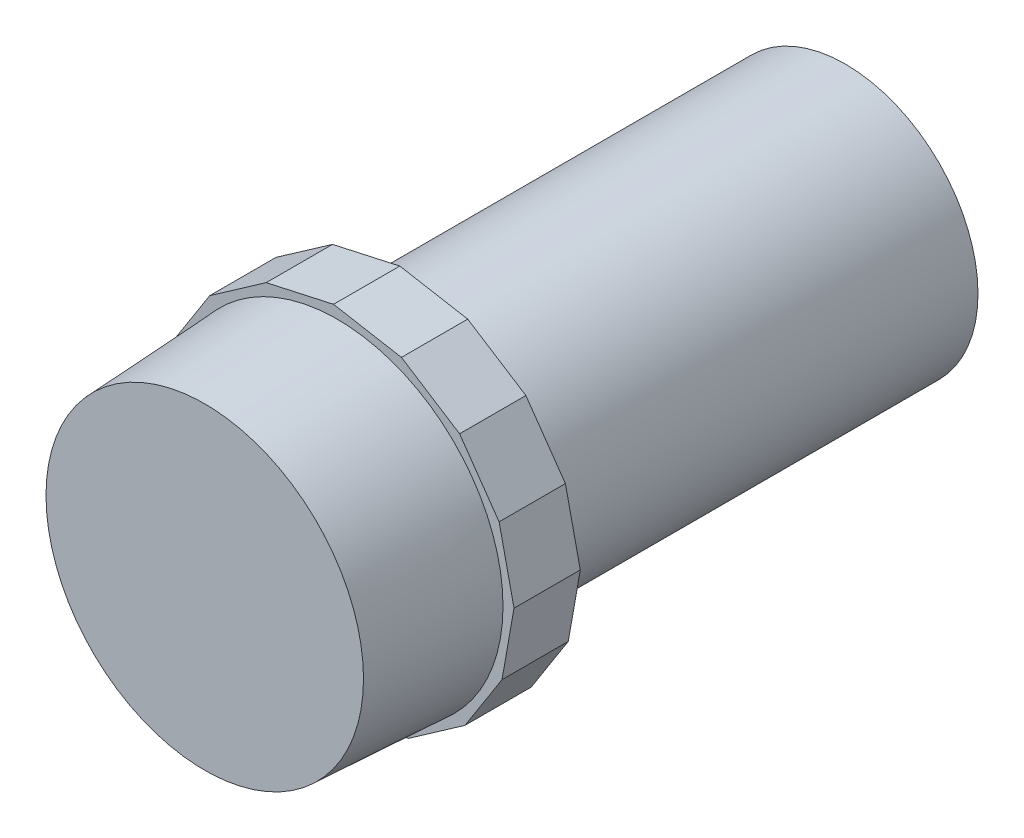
ISO-10303-21;
HEADER;
FILE_DESCRIPTION(('STEP AP214'),'2;1');
FILE_NAME('part.step','',(''),(''),'','','');
FILE_SCHEMA(('AUTOMOTIVE_DESIGN { 1 0 10303 214 1 1 1 1 }'));
ENDSEC;
DATA;
#1=APPLICATION_CONTEXT('core data for automotive mechanical design processes');
#2=APPLICATION_PROTOCOL_DEFINITION('international standard','automotive_design',2000,#1);
#3=PRODUCT_CONTEXT('',#1,'mechanical');
#4=PRODUCT('Part','Part','',(#3));
#5=PRODUCT_RELATED_PRODUCT_CATEGORY('part','',(#4));
#6=PRODUCT_DEFINITION_FORMATION('','',#4);
#7=PRODUCT_DEFINITION_CONTEXT('part definition',#1,'design');
#8=PRODUCT_DEFINITION('design','',#6,#7);
#9=PRODUCT_DEFINITION_SHAPE('','',#8);
#10=(LENGTH_UNIT() NAMED_UNIT(*) SI_UNIT(.MILLI.,.METRE.));
#11=(NAMED_UNIT(*) PLANE_ANGLE_UNIT() SI_UNIT($,.RADIAN.));
#12=(NAMED_UNIT(*) SI_UNIT($,.STERADIAN.) SOLID_ANGLE_UNIT());
#13=UNCERTAINTY_MEASURE_WITH_UNIT(LENGTH_MEASURE(1.E-05),#10,'distance_accuracy_value','');
#14=(GEOMETRIC_REPRESENTATION_CONTEXT(3) GLOBAL_UNCERTAINTY_ASSIGNED_CONTEXT((#13)) GLOBAL_UNIT_ASSIGNED_CONTEXT((#10,
#11,#12)) REPRESENTATION_CONTEXT('',''));
#15=CARTESIAN_POINT('',(0.,0.,0.));
#16=DIRECTION('',(0.,0.,1.));
#17=DIRECTION('',(1.,0.,0.));
#18=AXIS2_PLACEMENT_3D('',#15,#16,#17);
#19=CARTESIAN_POINT('',(0.,0.,-3.));
#20=DIRECTION('',(0.,0.,-1.));
#21=DIRECTION('',(-1.,0.,0.));
#22=AXIS2_PLACEMENT_3D('',#19,#20,#21);
#23=PLANE('',#22);
#24=CARTESIAN_POINT('',(0.,0.,-3.));
#25=DIRECTION('',(0.,0.,-1.));
#26=DIRECTION('',(-1.,0.,0.));
#27=AXIS2_PLACEMENT_3D('',#24,#25,#26);
#28=CIRCLE('',#27,6.);
#29=CARTESIAN_POINT('',(-6.,0.,-3.));
#30=VERTEX_POINT('',#29);
#31=EDGE_CURVE('E12',#30,#30,#28,.T.);
#32=ORIENTED_EDGE('',*,*,#31,.F.);
#33=EDGE_LOOP('',(#32));
#34=FACE_BOUND('',#33,.T.);
#35=DIRECTION('',(0.984722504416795,-0.17413095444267,0.));
#36=VECTOR('',#35,1.);
#37=CARTESIAN_POINT('',(1.36628061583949,7.72641070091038,-3.));
#38=LINE('',#37,#36);
#39=CARTESIAN_POINT('',(-0.170598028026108,7.99818081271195,-3.));
#40=VERTEX_POINT('',#39);
#41=CARTESIAN_POINT('',(2.90315925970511,7.4546405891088,-3.));
#42=VERTEX_POINT('',#41);
#43=EDGE_CURVE('E238',#40,#42,#38,.T.);
#44=ORIENTED_EDGE('',*,*,#43,.T.);
#45=DIRECTION('',(0.843127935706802,-0.537713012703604,0.));
#46=VECTOR('',#45,1.);
#47=CARTESIAN_POINT('',(4.21904806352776,6.61541975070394,-3.));
#48=LINE('',#47,#46);
#49=CARTESIAN_POINT('',(5.53493686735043,5.77619891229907,-3.));
#50=VERTEX_POINT('',#49);
#51=EDGE_CURVE('E224',#42,#50,#48,.T.);
#52=ORIENTED_EDGE('',*,*,#51,.T.);
#53=DIRECTION('',(0.573174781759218,-0.819433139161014,0.));
#54=VECTOR('',#53,1.);
#55=CARTESIAN_POINT('',(6.42950368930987,4.4972911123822,-3.));
#56=LINE('',#55,#54);
#57=CARTESIAN_POINT('',(7.32407051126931,3.21838331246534,-3.));
#58=VERTEX_POINT('',#57);
#59=EDGE_CURVE('E462',#50,#58,#56,.T.);
#60=ORIENTED_EDGE('',*,*,#59,.T.);
#61=DIRECTION('',(0.215960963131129,-0.976401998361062,0.));
#62=VECTOR('',#61,1.);
#63=CARTESIAN_POINT('',(7.66112566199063,1.69449067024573,-3.));
#64=LINE('',#63,#62);
#65=CARTESIAN_POINT('',(7.99818081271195,0.170598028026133,-3.));
#66=VERTEX_POINT('',#65);
#67=EDGE_CURVE('E121',#58,#66,#64,.T.);
#68=ORIENTED_EDGE('',*,*,#67,.T.);
#69=DIRECTION('',(-0.17413095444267,-0.984722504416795,0.));
#70=VECTOR('',#69,1.);
#71=CARTESIAN_POINT('',(7.72641070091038,-1.36628061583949,-3.));
#72=LINE('',#71,#70);
#73=CARTESIAN_POINT('',(7.45464058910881,-2.90315925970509,-3.));
#74=VERTEX_POINT('',#73);
#75=EDGE_CURVE('E310',#66,#74,#72,.T.);
#76=ORIENTED_EDGE('',*,*,#75,.T.);
#77=DIRECTION('',(-0.537713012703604,-0.843127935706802,0.));
#78=VECTOR('',#77,1.);
#79=CARTESIAN_POINT('',(6.61541975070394,-4.21904806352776,-3.));
#80=LINE('',#79,#78);
#81=CARTESIAN_POINT('',(5.77619891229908,-5.53493686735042,-3.));
#82=VERTEX_POINT('',#81);
#83=EDGE_CURVE('E113',#74,#82,#80,.T.);
#84=ORIENTED_EDGE('',*,*,#83,.T.);
#85=DIRECTION('',(-0.819433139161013,-0.573174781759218,0.));
#86=VECTOR('',#85,1.);
#87=CARTESIAN_POINT('',(4.4972911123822,-6.42950368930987,-3.));
#88=LINE('',#87,#86);
#89=CARTESIAN_POINT('',(3.21838331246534,-7.32407051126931,-3.));
#90=VERTEX_POINT('',#89);
#91=EDGE_CURVE('E297',#82,#90,#88,.T.);
#92=ORIENTED_EDGE('',*,*,#91,.T.);
#93=DIRECTION('',(-0.976401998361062,-0.215960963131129,0.));
#94=VECTOR('',#93,1.);
#95=CARTESIAN_POINT('',(1.69449067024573,-7.66112566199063,-3.));
#96=LINE('',#95,#94);
#97=CARTESIAN_POINT('',(0.170598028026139,-7.99818081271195,-3.));
#98=VERTEX_POINT('',#97);
#99=EDGE_CURVE('E423',#90,#98,#96,.T.);
#100=ORIENTED_EDGE('',*,*,#99,.T.);
#101=DIRECTION('',(-0.984722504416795,0.17413095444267,0.));
#102=VECTOR('',#101,1.);
#103=CARTESIAN_POINT('',(-1.36628061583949,-7.72641070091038,-3.));
#104=LINE('',#103,#102);
#105=CARTESIAN_POINT('',(-2.90315925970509,-7.45464058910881,-3.));
#106=VERTEX_POINT('',#105);
#107=EDGE_CURVE('E286',#98,#106,#104,.T.);
#108=ORIENTED_EDGE('',*,*,#107,.T.);
#109=DIRECTION('',(-0.843127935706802,0.537713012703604,0.));
#110=VECTOR('',#109,1.);
#111=CARTESIAN_POINT('',(-4.21904806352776,-6.61541975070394,-3.));
#112=LINE('',#111,#110);
#113=CARTESIAN_POINT('',(-5.53493686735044,-5.77619891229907,-3.));
#114=VERTEX_POINT('',#113);
#115=EDGE_CURVE('E426',#106,#114,#112,.T.);
#116=ORIENTED_EDGE('',*,*,#115,.T.);
#117=DIRECTION('',(-0.573174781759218,0.819433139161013,0.));
#118=VECTOR('',#117,1.);
#119=CARTESIAN_POINT('',(-6.42950368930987,-4.4972911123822,-3.));
#120=LINE('',#119,#118);
#121=CARTESIAN_POINT('',(-7.32407051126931,-3.21838331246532,-3.));
#122=VERTEX_POINT('',#121);
#123=EDGE_CURVE('E276',#114,#122,#120,.T.);
#124=ORIENTED_EDGE('',*,*,#123,.T.);
#125=DIRECTION('',(-0.215960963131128,0.976401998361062,0.));
#126=VECTOR('',#125,1.);
#127=CARTESIAN_POINT('',(-7.66112566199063,-1.69449067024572,-3.));
#128=LINE('',#127,#126);
#129=CARTESIAN_POINT('',(-7.99818081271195,-0.170598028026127,-3.));
#130=VERTEX_POINT('',#129);
#131=EDGE_CURVE('E437',#122,#130,#128,.T.);
#132=ORIENTED_EDGE('',*,*,#131,.T.);
#133=DIRECTION('',(0.17413095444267,0.984722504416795,0.));
#134=VECTOR('',#133,1.);
#135=CARTESIAN_POINT('',(-7.72641070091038,1.36628061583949,-3.));
#136=LINE('',#135,#134);
#137=CARTESIAN_POINT('',(-7.45464058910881,2.90315925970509,-3.));
#138=VERTEX_POINT('',#137);
#139=EDGE_CURVE('E266',#130,#138,#136,.T.);
#140=ORIENTED_EDGE('',*,*,#139,.T.);
#141=DIRECTION('',(0.537713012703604,0.843127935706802,0.));
#142=VECTOR('',#141,1.);
#143=CARTESIAN_POINT('',(-6.61541975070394,4.21904806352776,-3.));
#144=LINE('',#143,#142);
#145=CARTESIAN_POINT('',(-5.77619891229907,5.53493686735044,-3.));
#146=VERTEX_POINT('',#145);
#147=EDGE_CURVE('E446',#138,#146,#144,.T.);
#148=ORIENTED_EDGE('',*,*,#147,.T.);
#149=DIRECTION('',(0.819433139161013,0.573174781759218,0.));
#150=VECTOR('',#149,1.);
#151=CARTESIAN_POINT('',(-4.4972911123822,6.42950368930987,-3.));
#152=LINE('',#151,#150);
#153=CARTESIAN_POINT('',(-3.21838331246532,7.32407051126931,-3.));
#154=VERTEX_POINT('',#153);
#155=EDGE_CURVE('E259',#146,#154,#152,.T.);
#156=ORIENTED_EDGE('',*,*,#155,.T.);
#157=DIRECTION('',(0.976401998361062,0.215960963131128,0.));
#158=VECTOR('',#157,1.);
#159=CARTESIAN_POINT('',(-1.69449067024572,7.66112566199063,-3.));
#160=LINE('',#159,#158);
#161=EDGE_CURVE('E91',#154,#40,#160,.T.);
#162=ORIENTED_EDGE('',*,*,#161,.T.);
#163=EDGE_LOOP('',(#44,#52,#60,#68,#76,#84,#92,#100,#108,#116,#124,#132,#140,#148,#156,#162));
#164=FACE_BOUND('',#163,.T.);
#165=ADVANCED_FACE('F65',(#34,#164),#23,.T.);
#166=CARTESIAN_POINT('',(0.,0.,0.));
#167=DIRECTION('',(0.,0.,-1.));
#168=DIRECTION('',(-1.,0.,0.));
#169=AXIS2_PLACEMENT_3D('',#166,#167,#168);
#170=PLANE('',#169);
#171=CARTESIAN_POINT('',(0.,0.,0.));
#172=DIRECTION('',(0.,0.,1.));
#173=DIRECTION('',(1.,0.,0.));
#174=AXIS2_PLACEMENT_3D('',#171,#172,#173);
#175=CIRCLE('',#174,7.5);
#176=CARTESIAN_POINT('',(7.5,0.,0.));
#177=VERTEX_POINT('',#176);
#178=EDGE_CURVE('E242',#177,#177,#175,.T.);
#179=ORIENTED_EDGE('',*,*,#178,.F.);
#180=EDGE_LOOP('',(#179));
#181=FACE_BOUND('',#180,.T.);
#182=DIRECTION('',(0.843127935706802,-0.537713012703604,0.));
#183=VECTOR('',#182,1.);
#184=CARTESIAN_POINT('',(4.21904806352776,6.61541975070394,0.));
#185=LINE('',#184,#183);
#186=CARTESIAN_POINT('',(2.90315925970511,7.4546405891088,0.));
#187=VERTEX_POINT('',#186);
#188=CARTESIAN_POINT('',(5.53493686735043,5.77619891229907,0.));
#189=VERTEX_POINT('',#188);
#190=EDGE_CURVE('E82',#187,#189,#185,.T.);
#191=ORIENTED_EDGE('',*,*,#190,.F.);
#192=DIRECTION('',(0.984722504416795,-0.17413095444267,0.));
#193=VECTOR('',#192,1.);
#194=CARTESIAN_POINT('',(1.36628061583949,7.72641070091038,0.));
#195=LINE('',#194,#193);
#196=CARTESIAN_POINT('',(-0.170598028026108,7.99818081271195,0.));
#197=VERTEX_POINT('',#196);
#198=EDGE_CURVE('E240',#197,#187,#195,.T.);
#199=ORIENTED_EDGE('',*,*,#198,.F.);
#200=DIRECTION('',(0.976401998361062,0.215960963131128,0.));
#201=VECTOR('',#200,1.);
#202=CARTESIAN_POINT('',(-1.69449067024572,7.66112566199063,0.));
#203=LINE('',#202,#201);
#204=CARTESIAN_POINT('',(-3.21838331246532,7.32407051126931,0.));
#205=VERTEX_POINT('',#204);
#206=EDGE_CURVE('E127',#205,#197,#203,.T.);
#207=ORIENTED_EDGE('',*,*,#206,.F.);
#208=DIRECTION('',(0.819433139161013,0.573174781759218,0.));
#209=VECTOR('',#208,1.);
#210=CARTESIAN_POINT('',(-4.4972911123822,6.42950368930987,0.));
#211=LINE('',#210,#209);
#212=CARTESIAN_POINT('',(-5.77619891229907,5.53493686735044,0.));
#213=VERTEX_POINT('',#212);
#214=EDGE_CURVE('E250',#213,#205,#211,.T.);
#215=ORIENTED_EDGE('',*,*,#214,.F.);
#216=DIRECTION('',(0.537713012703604,0.843127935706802,0.));
#217=VECTOR('',#216,1.);
#218=CARTESIAN_POINT('',(-6.61541975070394,4.21904806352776,0.));
#219=LINE('',#218,#217);
#220=CARTESIAN_POINT('',(-7.45464058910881,2.90315925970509,0.));
#221=VERTEX_POINT('',#220);
#222=EDGE_CURVE('E141',#221,#213,#219,.T.);
#223=ORIENTED_EDGE('',*,*,#222,.F.);
#224=DIRECTION('',(0.17413095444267,0.984722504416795,0.));
#225=VECTOR('',#224,1.);
#226=CARTESIAN_POINT('',(-7.72641070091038,1.36628061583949,0.));
#227=LINE('',#226,#225);
#228=CARTESIAN_POINT('',(-7.99818081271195,-0.170598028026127,0.));
#229=VERTEX_POINT('',#228);
#230=EDGE_CURVE('E262',#229,#221,#227,.T.);
#231=ORIENTED_EDGE('',*,*,#230,.F.);
#232=DIRECTION('',(-0.215960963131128,0.976401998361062,0.));
#233=VECTOR('',#232,1.);
#234=CARTESIAN_POINT('',(-7.66112566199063,-1.69449067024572,0.));
#235=LINE('',#234,#233);
#236=CARTESIAN_POINT('',(-7.32407051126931,-3.21838331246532,0.));
#237=VERTEX_POINT('',#236);
#238=EDGE_CURVE('E156',#237,#229,#235,.T.);
#239=ORIENTED_EDGE('',*,*,#238,.F.);
#240=DIRECTION('',(-0.573174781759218,0.819433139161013,0.));
#241=VECTOR('',#240,1.);
#242=CARTESIAN_POINT('',(-6.42950368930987,-4.4972911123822,0.));
#243=LINE('',#242,#241);
#244=CARTESIAN_POINT('',(-5.53493686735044,-5.77619891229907,0.));
#245=VERTEX_POINT('',#244);
#246=EDGE_CURVE('E272',#245,#237,#243,.T.);
#247=ORIENTED_EDGE('',*,*,#246,.F.);
#248=DIRECTION('',(-0.843127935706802,0.537713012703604,0.));
#249=VECTOR('',#248,1.);
#250=CARTESIAN_POINT('',(-4.21904806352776,-6.61541975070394,0.));
#251=LINE('',#250,#249);
#252=CARTESIAN_POINT('',(-2.90315925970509,-7.45464058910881,0.));
#253=VERTEX_POINT('',#252);
#254=EDGE_CURVE('E171',#253,#245,#251,.T.);
#255=ORIENTED_EDGE('',*,*,#254,.F.);
#256=DIRECTION('',(-0.984722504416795,0.17413095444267,0.));
#257=VECTOR('',#256,1.);
#258=CARTESIAN_POINT('',(-1.36628061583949,-7.72641070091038,0.));
#259=LINE('',#258,#257);
#260=CARTESIAN_POINT('',(0.170598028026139,-7.99818081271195,0.));
#261=VERTEX_POINT('',#260);
#262=EDGE_CURVE('E282',#261,#253,#259,.T.);
#263=ORIENTED_EDGE('',*,*,#262,.F.);
#264=DIRECTION('',(-0.976401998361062,-0.215960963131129,0.));
#265=VECTOR('',#264,1.);
#266=CARTESIAN_POINT('',(1.69449067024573,-7.66112566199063,0.));
#267=LINE('',#266,#265);
#268=CARTESIAN_POINT('',(3.21838331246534,-7.32407051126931,0.));
#269=VERTEX_POINT('',#268);
#270=EDGE_CURVE('E186',#269,#261,#267,.T.);
#271=ORIENTED_EDGE('',*,*,#270,.F.);
#272=DIRECTION('',(-0.819433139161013,-0.573174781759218,0.));
#273=VECTOR('',#272,1.);
#274=CARTESIAN_POINT('',(4.4972911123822,-6.42950368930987,0.));
#275=LINE('',#274,#273);
#276=CARTESIAN_POINT('',(5.77619891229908,-5.53493686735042,0.));
#277=VERTEX_POINT('',#276);
#278=EDGE_CURVE('E293',#277,#269,#275,.T.);
#279=ORIENTED_EDGE('',*,*,#278,.F.);
#280=DIRECTION('',(-0.537713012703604,-0.843127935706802,0.));
#281=VECTOR('',#280,1.);
#282=CARTESIAN_POINT('',(6.61541975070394,-4.21904806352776,0.));
#283=LINE('',#282,#281);
#284=CARTESIAN_POINT('',(7.45464058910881,-2.90315925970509,0.));
#285=VERTEX_POINT('',#284);
#286=EDGE_CURVE('E198',#285,#277,#283,.T.);
#287=ORIENTED_EDGE('',*,*,#286,.F.);
#288=DIRECTION('',(-0.17413095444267,-0.984722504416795,0.));
#289=VECTOR('',#288,1.);
#290=CARTESIAN_POINT('',(7.72641070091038,-1.36628061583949,0.));
#291=LINE('',#290,#289);
#292=CARTESIAN_POINT('',(7.99818081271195,0.170598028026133,0.));
#293=VERTEX_POINT('',#292);
#294=EDGE_CURVE('E306',#293,#285,#291,.T.);
#295=ORIENTED_EDGE('',*,*,#294,.F.);
#296=DIRECTION('',(0.215960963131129,-0.976401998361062,0.));
#297=VECTOR('',#296,1.);
#298=CARTESIAN_POINT('',(7.66112566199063,1.69449067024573,0.));
#299=LINE('',#298,#297);
#300=CARTESIAN_POINT('',(7.32407051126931,3.21838331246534,0.));
#301=VERTEX_POINT('',#300);
#302=EDGE_CURVE('E209',#301,#293,#299,.T.);
#303=ORIENTED_EDGE('',*,*,#302,.F.);
#304=DIRECTION('',(0.573174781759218,-0.819433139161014,0.));
#305=VECTOR('',#304,1.);
#306=CARTESIAN_POINT('',(6.42950368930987,4.4972911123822,0.));
#307=LINE('',#306,#305);
#308=EDGE_CURVE('E463',#189,#301,#307,.T.);
#309=ORIENTED_EDGE('',*,*,#308,.F.);
#310=EDGE_LOOP('',(#191,#199,#207,#215,#223,#231,#239,#247,#255,#263,#271,#279,#287,#295,#303,#309));
#311=FACE_BOUND('',#310,.T.);
#312=ADVANCED_FACE('F326',(#181,#311),#170,.F.);
#313=CARTESIAN_POINT('',(0.,0.,0.));
#314=DIRECTION('',(0.,0.,-1.));
#315=DIRECTION('',(1.,0.,0.));
#316=AXIS2_PLACEMENT_3D('',#313,#314,#315);
#317=CONICAL_SURFACE('',#316,7.5,0.0523598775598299);
#318=CARTESIAN_POINT('',(0.,0.,6.));
#319=DIRECTION('',(0.,0.,1.));
#320=DIRECTION('',(1.,0.,0.));
#321=AXIS2_PLACEMENT_3D('',#318,#319,#320);
#322=CIRCLE('',#321,7.18555332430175);
#323=CARTESIAN_POINT('',(7.18555332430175,0.,6.));
#324=VERTEX_POINT('',#323);
#325=EDGE_CURVE('E69',#324,#324,#322,.T.);
#326=ORIENTED_EDGE('',*,*,#325,.F.);
#327=EDGE_LOOP('',(#326));
#328=FACE_BOUND('',#327,.T.);
#329=ORIENTED_EDGE('',*,*,#178,.T.);
#330=EDGE_LOOP('',(#329));
#331=FACE_BOUND('',#330,.T.);
#332=ADVANCED_FACE('F67',(#328,#331),#317,.T.);
#333=CARTESIAN_POINT('',(0.,0.,6.));
#334=DIRECTION('',(0.,0.,1.));
#335=DIRECTION('',(1.,0.,0.));
#336=AXIS2_PLACEMENT_3D('',#333,#334,#335);
#337=PLANE('',#336);
#338=ORIENTED_EDGE('',*,*,#325,.T.);
#339=EDGE_LOOP('',(#338));
#340=FACE_BOUND('',#339,.T.);
#341=ADVANCED_FACE('F323',(#340),#337,.T.);
#342=CARTESIAN_POINT('',(1.36628061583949,7.72641070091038,0.));
#343=DIRECTION('',(0.17413095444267,0.984722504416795,0.));
#344=DIRECTION('',(-0.984722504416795,0.17413095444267,0.));
#345=AXIS2_PLACEMENT_3D('',#342,#343,#344);
#346=PLANE('',#345);
#347=ORIENTED_EDGE('',*,*,#43,.F.);
#348=DIRECTION('',(0.,0.,-1.));
#349=VECTOR('',#348,1.);
#350=CARTESIAN_POINT('',(-0.170598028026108,7.99818081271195,0.));
#351=LINE('',#350,#349);
#352=EDGE_CURVE('E133',#197,#40,#351,.T.);
#353=ORIENTED_EDGE('',*,*,#352,.F.);
#354=ORIENTED_EDGE('',*,*,#198,.T.);
#355=DIRECTION('',(0.,0.,-1.));
#356=VECTOR('',#355,1.);
#357=CARTESIAN_POINT('',(2.90315925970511,7.4546405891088,0.));
#358=LINE('',#357,#356);
#359=EDGE_CURVE('E220',#187,#42,#358,.T.);
#360=ORIENTED_EDGE('',*,*,#359,.T.);
#361=EDGE_LOOP('',(#347,#353,#354,#360));
#362=FACE_BOUND('',#361,.T.);
#363=ADVANCED_FACE('F237',(#362),#346,.T.);
#364=CARTESIAN_POINT('',(-4.4972911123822,6.42950368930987,0.));
#365=DIRECTION('',(-0.573174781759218,0.819433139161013,0.));
#366=DIRECTION('',(-0.819433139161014,-0.573174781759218,0.));
#367=AXIS2_PLACEMENT_3D('',#364,#365,#366);
#368=PLANE('',#367);
#369=ORIENTED_EDGE('',*,*,#155,.F.);
#370=DIRECTION('',(0.,0.,-1.));
#371=VECTOR('',#370,1.);
#372=CARTESIAN_POINT('',(-5.77619891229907,5.53493686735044,0.));
#373=LINE('',#372,#371);
#374=EDGE_CURVE('E147',#213,#146,#373,.T.);
#375=ORIENTED_EDGE('',*,*,#374,.F.);
#376=ORIENTED_EDGE('',*,*,#214,.T.);
#377=DIRECTION('',(0.,0.,-1.));
#378=VECTOR('',#377,1.);
#379=CARTESIAN_POINT('',(-3.21838331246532,7.32407051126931,0.));
#380=LINE('',#379,#378);
#381=EDGE_CURVE('E457',#205,#154,#380,.T.);
#382=ORIENTED_EDGE('',*,*,#381,.T.);
#383=EDGE_LOOP('',(#369,#375,#376,#382));
#384=FACE_BOUND('',#383,.T.);
#385=ADVANCED_FACE('F360',(#384),#368,.T.);
#386=CARTESIAN_POINT('',(-7.72641070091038,1.36628061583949,0.));
#387=DIRECTION('',(-0.984722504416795,0.17413095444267,0.));
#388=DIRECTION('',(-0.17413095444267,-0.984722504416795,0.));
#389=AXIS2_PLACEMENT_3D('',#386,#387,#388);
#390=PLANE('',#389);
#391=ORIENTED_EDGE('',*,*,#139,.F.);
#392=DIRECTION('',(0.,0.,-1.));
#393=VECTOR('',#392,1.);
#394=CARTESIAN_POINT('',(-7.99818081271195,-0.170598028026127,0.));
#395=LINE('',#394,#393);
#396=EDGE_CURVE('E162',#229,#130,#395,.T.);
#397=ORIENTED_EDGE('',*,*,#396,.F.);
#398=ORIENTED_EDGE('',*,*,#230,.T.);
#399=DIRECTION('',(0.,0.,-1.));
#400=VECTOR('',#399,1.);
#401=CARTESIAN_POINT('',(-7.45464058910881,2.90315925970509,0.));
#402=LINE('',#401,#400);
#403=EDGE_CURVE('E449',#221,#138,#402,.T.);
#404=ORIENTED_EDGE('',*,*,#403,.T.);
#405=EDGE_LOOP('',(#391,#397,#398,#404));
#406=FACE_BOUND('',#405,.T.);
#407=ADVANCED_FACE('F356',(#406),#390,.T.);
#408=CARTESIAN_POINT('',(-6.42950368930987,-4.4972911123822,0.));
#409=DIRECTION('',(-0.819433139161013,-0.573174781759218,0.));
#410=DIRECTION('',(0.573174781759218,-0.819433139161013,0.));
#411=AXIS2_PLACEMENT_3D('',#408,#409,#410);
#412=PLANE('',#411);
#413=ORIENTED_EDGE('',*,*,#123,.F.);
#414=DIRECTION('',(0.,0.,-1.));
#415=VECTOR('',#414,1.);
#416=CARTESIAN_POINT('',(-5.53493686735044,-5.77619891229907,0.));
#417=LINE('',#416,#415);
#418=EDGE_CURVE('E177',#245,#114,#417,.T.);
#419=ORIENTED_EDGE('',*,*,#418,.F.);
#420=ORIENTED_EDGE('',*,*,#246,.T.);
#421=DIRECTION('',(0.,0.,-1.));
#422=VECTOR('',#421,1.);
#423=CARTESIAN_POINT('',(-7.32407051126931,-3.21838331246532,0.));
#424=LINE('',#423,#422);
#425=EDGE_CURVE('E440',#237,#122,#424,.T.);
#426=ORIENTED_EDGE('',*,*,#425,.T.);
#427=EDGE_LOOP('',(#413,#419,#420,#426));
#428=FACE_BOUND('',#427,.T.);
#429=ADVANCED_FACE('F352',(#428),#412,.T.);
#430=CARTESIAN_POINT('',(-1.36628061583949,-7.72641070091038,0.));
#431=DIRECTION('',(-0.174130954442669,-0.984722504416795,0.));
#432=DIRECTION('',(0.984722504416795,-0.17413095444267,0.));
#433=AXIS2_PLACEMENT_3D('',#430,#431,#432);
#434=PLANE('',#433);
#435=ORIENTED_EDGE('',*,*,#107,.F.);
#436=DIRECTION('',(0.,0.,-1.));
#437=VECTOR('',#436,1.);
#438=CARTESIAN_POINT('',(0.170598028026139,-7.99818081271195,0.));
#439=LINE('',#438,#437);
#440=EDGE_CURVE('E192',#261,#98,#439,.T.);
#441=ORIENTED_EDGE('',*,*,#440,.F.);
#442=ORIENTED_EDGE('',*,*,#262,.T.);
#443=DIRECTION('',(0.,0.,-1.));
#444=VECTOR('',#443,1.);
#445=CARTESIAN_POINT('',(-2.90315925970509,-7.45464058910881,0.));
#446=LINE('',#445,#444);
#447=EDGE_CURVE('E431',#253,#106,#446,.T.);
#448=ORIENTED_EDGE('',*,*,#447,.T.);
#449=EDGE_LOOP('',(#435,#441,#442,#448));
#450=FACE_BOUND('',#449,.T.);
#451=ADVANCED_FACE('F348',(#450),#434,.T.);
#452=CARTESIAN_POINT('',(4.4972911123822,-6.42950368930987,0.));
#453=DIRECTION('',(0.573174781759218,-0.819433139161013,0.));
#454=DIRECTION('',(0.819433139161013,0.573174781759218,0.));
#455=AXIS2_PLACEMENT_3D('',#452,#453,#454);
#456=PLANE('',#455);
#457=ORIENTED_EDGE('',*,*,#91,.F.);
#458=DIRECTION('',(0.,0.,-1.));
#459=VECTOR('',#458,1.);
#460=CARTESIAN_POINT('',(5.77619891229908,-5.53493686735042,0.));
#461=LINE('',#460,#459);
#462=EDGE_CURVE('E204',#277,#82,#461,.T.);
#463=ORIENTED_EDGE('',*,*,#462,.F.);
#464=ORIENTED_EDGE('',*,*,#278,.T.);
#465=DIRECTION('',(0.,0.,-1.));
#466=VECTOR('',#465,1.);
#467=CARTESIAN_POINT('',(3.21838331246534,-7.32407051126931,0.));
#468=LINE('',#467,#466);
#469=EDGE_CURVE('E290',#269,#90,#468,.T.);
#470=ORIENTED_EDGE('',*,*,#469,.T.);
#471=EDGE_LOOP('',(#457,#463,#464,#470));
#472=FACE_BOUND('',#471,.T.);
#473=ADVANCED_FACE('F344',(#472),#456,.T.);
#474=CARTESIAN_POINT('',(7.72641070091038,-1.36628061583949,0.));
#475=DIRECTION('',(0.984722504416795,-0.17413095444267,0.));
#476=DIRECTION('',(0.17413095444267,0.984722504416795,0.));
#477=AXIS2_PLACEMENT_3D('',#474,#475,#476);
#478=PLANE('',#477);
#479=ORIENTED_EDGE('',*,*,#75,.F.);
#480=DIRECTION('',(0.,0.,-1.));
#481=VECTOR('',#480,1.);
#482=CARTESIAN_POINT('',(7.99818081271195,0.170598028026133,0.));
#483=LINE('',#482,#481);
#484=EDGE_CURVE('E215',#293,#66,#483,.T.);
#485=ORIENTED_EDGE('',*,*,#484,.F.);
#486=ORIENTED_EDGE('',*,*,#294,.T.);
#487=DIRECTION('',(0.,0.,-1.));
#488=VECTOR('',#487,1.);
#489=CARTESIAN_POINT('',(7.45464058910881,-2.90315925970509,0.));
#490=LINE('',#489,#488);
#491=EDGE_CURVE('E418',#285,#74,#490,.T.);
#492=ORIENTED_EDGE('',*,*,#491,.T.);
#493=EDGE_LOOP('',(#479,#485,#486,#492));
#494=FACE_BOUND('',#493,.T.);
#495=ADVANCED_FACE('F340',(#494),#478,.T.);
#496=CARTESIAN_POINT('',(6.42950368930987,4.4972911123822,0.));
#497=DIRECTION('',(0.819433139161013,0.573174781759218,0.));
#498=DIRECTION('',(-0.573174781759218,0.819433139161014,0.));
#499=AXIS2_PLACEMENT_3D('',#496,#497,#498);
#500=PLANE('',#499);
#501=ORIENTED_EDGE('',*,*,#59,.F.);
#502=DIRECTION('',(0.,0.,-1.));
#503=VECTOR('',#502,1.);
#504=CARTESIAN_POINT('',(5.53493686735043,5.77619891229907,0.));
#505=LINE('',#504,#503);
#506=EDGE_CURVE('E226',#189,#50,#505,.T.);
#507=ORIENTED_EDGE('',*,*,#506,.F.);
#508=ORIENTED_EDGE('',*,*,#308,.T.);
#509=DIRECTION('',(0.,0.,-1.));
#510=VECTOR('',#509,1.);
#511=CARTESIAN_POINT('',(7.32407051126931,3.21838331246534,0.));
#512=LINE('',#511,#510);
#513=EDGE_CURVE('E411',#301,#58,#512,.T.);
#514=ORIENTED_EDGE('',*,*,#513,.T.);
#515=EDGE_LOOP('',(#501,#507,#508,#514));
#516=FACE_BOUND('',#515,.T.);
#517=ADVANCED_FACE('F343',(#516),#500,.T.);
#518=CARTESIAN_POINT('',(-1.69449067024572,7.66112566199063,0.));
#519=DIRECTION('',(-0.215960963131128,0.976401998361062,0.));
#520=DIRECTION('',(-0.976401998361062,-0.215960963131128,0.));
#521=AXIS2_PLACEMENT_3D('',#518,#519,#520);
#522=PLANE('',#521);
#523=ORIENTED_EDGE('',*,*,#161,.F.);
#524=ORIENTED_EDGE('',*,*,#381,.F.);
#525=ORIENTED_EDGE('',*,*,#206,.T.);
#526=ORIENTED_EDGE('',*,*,#352,.T.);
#527=EDGE_LOOP('',(#523,#524,#525,#526));
#528=FACE_BOUND('',#527,.T.);
#529=ADVANCED_FACE('F369',(#528),#522,.T.);
#530=CARTESIAN_POINT('',(-6.61541975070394,4.21904806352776,0.));
#531=DIRECTION('',(-0.843127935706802,0.537713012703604,0.));
#532=DIRECTION('',(-0.537713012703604,-0.843127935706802,0.));
#533=AXIS2_PLACEMENT_3D('',#530,#531,#532);
#534=PLANE('',#533);
#535=ORIENTED_EDGE('',*,*,#147,.F.);
#536=ORIENTED_EDGE('',*,*,#403,.F.);
#537=ORIENTED_EDGE('',*,*,#222,.T.);
#538=ORIENTED_EDGE('',*,*,#374,.T.);
#539=EDGE_LOOP('',(#535,#536,#537,#538));
#540=FACE_BOUND('',#539,.T.);
#541=ADVANCED_FACE('F373',(#540),#534,.T.);
#542=CARTESIAN_POINT('',(-7.66112566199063,-1.69449067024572,0.));
#543=DIRECTION('',(-0.976401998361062,-0.215960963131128,0.));
#544=DIRECTION('',(0.215960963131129,-0.976401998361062,0.));
#545=AXIS2_PLACEMENT_3D('',#542,#543,#544);
#546=PLANE('',#545);
#547=ORIENTED_EDGE('',*,*,#131,.F.);
#548=ORIENTED_EDGE('',*,*,#425,.F.);
#549=ORIENTED_EDGE('',*,*,#238,.T.);
#550=ORIENTED_EDGE('',*,*,#396,.T.);
#551=EDGE_LOOP('',(#547,#548,#549,#550));
#552=FACE_BOUND('',#551,.T.);
#553=ADVANCED_FACE('F376',(#552),#546,.T.);
#554=CARTESIAN_POINT('',(-4.21904806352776,-6.61541975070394,0.));
#555=DIRECTION('',(-0.537713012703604,-0.843127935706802,0.));
#556=DIRECTION('',(0.843127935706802,-0.537713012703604,0.));
#557=AXIS2_PLACEMENT_3D('',#554,#555,#556);
#558=PLANE('',#557);
#559=ORIENTED_EDGE('',*,*,#115,.F.);
#560=ORIENTED_EDGE('',*,*,#447,.F.);
#561=ORIENTED_EDGE('',*,*,#254,.T.);
#562=ORIENTED_EDGE('',*,*,#418,.T.);
#563=EDGE_LOOP('',(#559,#560,#561,#562));
#564=FACE_BOUND('',#563,.T.);
#565=ADVANCED_FACE('F379',(#564),#558,.T.);
#566=CARTESIAN_POINT('',(1.69449067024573,-7.66112566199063,0.));
#567=DIRECTION('',(0.215960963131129,-0.976401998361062,0.));
#568=DIRECTION('',(0.976401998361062,0.215960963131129,0.));
#569=AXIS2_PLACEMENT_3D('',#566,#567,#568);
#570=PLANE('',#569);
#571=ORIENTED_EDGE('',*,*,#99,.F.);
#572=ORIENTED_EDGE('',*,*,#469,.F.);
#573=ORIENTED_EDGE('',*,*,#270,.T.);
#574=ORIENTED_EDGE('',*,*,#440,.T.);
#575=EDGE_LOOP('',(#571,#572,#573,#574));
#576=FACE_BOUND('',#575,.T.);
#577=ADVANCED_FACE('F382',(#576),#570,.T.);
#578=CARTESIAN_POINT('',(6.61541975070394,-4.21904806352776,0.));
#579=DIRECTION('',(0.843127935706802,-0.537713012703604,0.));
#580=DIRECTION('',(0.537713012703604,0.843127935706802,0.));
#581=AXIS2_PLACEMENT_3D('',#578,#579,#580);
#582=PLANE('',#581);
#583=ORIENTED_EDGE('',*,*,#83,.F.);
#584=ORIENTED_EDGE('',*,*,#491,.F.);
#585=ORIENTED_EDGE('',*,*,#286,.T.);
#586=ORIENTED_EDGE('',*,*,#462,.T.);
#587=EDGE_LOOP('',(#583,#584,#585,#586));
#588=FACE_BOUND('',#587,.T.);
#589=ADVANCED_FACE('F385',(#588),#582,.T.);
#590=CARTESIAN_POINT('',(7.66112566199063,1.69449067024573,0.));
#591=DIRECTION('',(0.976401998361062,0.215960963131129,0.));
#592=DIRECTION('',(-0.215960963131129,0.976401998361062,0.));
#593=AXIS2_PLACEMENT_3D('',#590,#591,#592);
#594=PLANE('',#593);
#595=ORIENTED_EDGE('',*,*,#67,.F.);
#596=ORIENTED_EDGE('',*,*,#513,.F.);
#597=ORIENTED_EDGE('',*,*,#302,.T.);
#598=ORIENTED_EDGE('',*,*,#484,.T.);
#599=EDGE_LOOP('',(#595,#596,#597,#598));
#600=FACE_BOUND('',#599,.T.);
#601=ADVANCED_FACE('F388',(#600),#594,.T.);
#602=CARTESIAN_POINT('',(4.21904806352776,6.61541975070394,0.));
#603=DIRECTION('',(0.537713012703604,0.843127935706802,0.));
#604=DIRECTION('',(-0.843127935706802,0.537713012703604,0.));
#605=AXIS2_PLACEMENT_3D('',#602,#603,#604);
#606=PLANE('',#605);
#607=ORIENTED_EDGE('',*,*,#51,.F.);
#608=ORIENTED_EDGE('',*,*,#359,.F.);
#609=ORIENTED_EDGE('',*,*,#190,.T.);
#610=ORIENTED_EDGE('',*,*,#506,.T.);
#611=EDGE_LOOP('',(#607,#608,#609,#610));
#612=FACE_BOUND('',#611,.T.);
#613=ADVANCED_FACE('F225',(#612),#606,.T.);
#614=CARTESIAN_POINT('',(0.,0.,-23.));
#615=DIRECTION('',(0.,0.,1.));
#616=DIRECTION('',(1.,0.,0.));
#617=AXIS2_PLACEMENT_3D('',#614,#615,#616);
#618=CYLINDRICAL_SURFACE('',#617,6.);
#619=CARTESIAN_POINT('',(0.,0.,-23.));
#620=DIRECTION('',(0.,0.,-1.));
#621=DIRECTION('',(-1.,0.,0.));
#622=AXIS2_PLACEMENT_3D('',#619,#620,#621);
#623=CIRCLE('',#622,6.);
#624=CARTESIAN_POINT('',(-6.,0.,-23.));
#625=VERTEX_POINT('',#624);
#626=EDGE_CURVE('E232',#625,#625,#623,.T.);
#627=ORIENTED_EDGE('',*,*,#626,.F.);
#628=EDGE_LOOP('',(#627));
#629=FACE_BOUND('',#628,.T.);
#630=ORIENTED_EDGE('',*,*,#31,.T.);
#631=EDGE_LOOP('',(#630));
#632=FACE_BOUND('',#631,.T.);
#633=ADVANCED_FACE('F393',(#629,#632),#618,.T.);
#634=CARTESIAN_POINT('',(0.,0.,-23.));
#635=DIRECTION('',(0.,0.,-1.));
#636=DIRECTION('',(-1.,0.,0.));
#637=AXIS2_PLACEMENT_3D('',#634,#635,#636);
#638=PLANE('',#637);
#639=ORIENTED_EDGE('',*,*,#626,.T.);
#640=EDGE_LOOP('',(#639));
#641=FACE_BOUND('',#640,.T.);
#642=ADVANCED_FACE('F396',(#641),#638,.T.);
#643=CLOSED_SHELL('',(#165,#312,#332,#341,#363,#385,#407,#429,#451,#473,#495,#517,#529,#541,
#553,#565,#577,#589,#601,#613,#633,#642));
#644=MANIFOLD_SOLID_BREP('B2',#643);
#645=ADVANCED_BREP_SHAPE_REPRESENTATION('',(#18,#644),#14);
#646=SHAPE_DEFINITION_REPRESENTATION(#9,#645);
ENDSEC;
END-ISO-10303-21;
